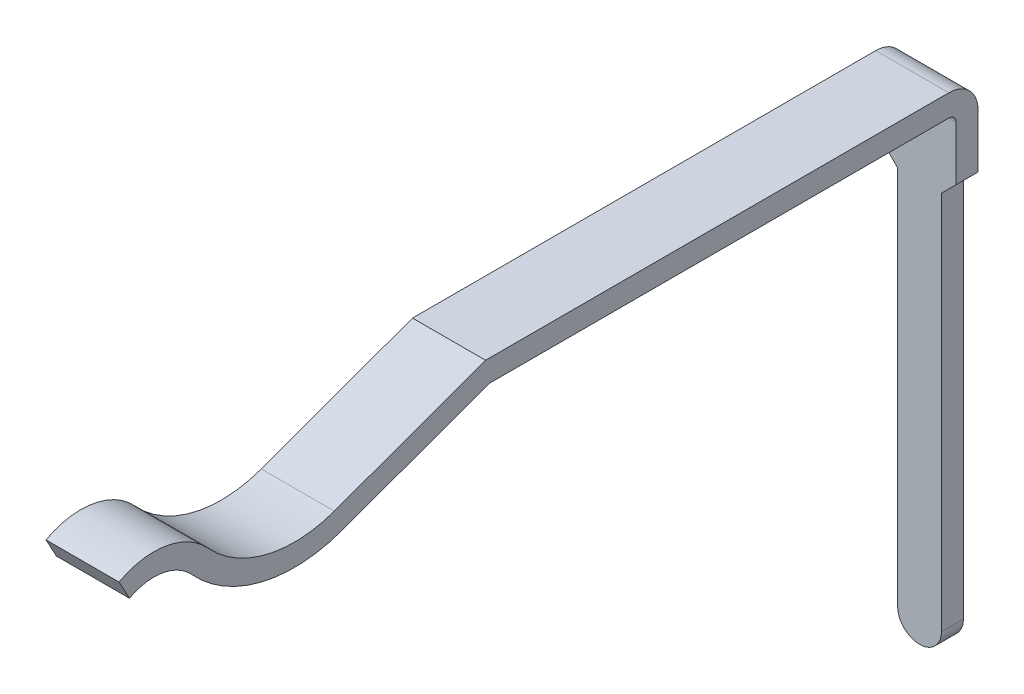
ISO-10303-21;
HEADER;
FILE_DESCRIPTION(('STEP AP214'),'2;1');
FILE_NAME('part.step','',(''),(''),'','','');
FILE_SCHEMA(('AUTOMOTIVE_DESIGN { 1 0 10303 214 1 1 1 1 }'));
ENDSEC;
DATA;
#1=APPLICATION_CONTEXT('core data for automotive mechanical design processes');
#2=APPLICATION_PROTOCOL_DEFINITION('international standard','automotive_design',2000,#1);
#3=PRODUCT_CONTEXT('',#1,'mechanical');
#4=PRODUCT('Part','Part','',(#3));
#5=PRODUCT_RELATED_PRODUCT_CATEGORY('part','',(#4));
#6=PRODUCT_DEFINITION_FORMATION('','',#4);
#7=PRODUCT_DEFINITION_CONTEXT('part definition',#1,'design');
#8=PRODUCT_DEFINITION('design','',#6,#7);
#9=PRODUCT_DEFINITION_SHAPE('','',#8);
#10=(LENGTH_UNIT() NAMED_UNIT(*) SI_UNIT(.MILLI.,.METRE.));
#11=(NAMED_UNIT(*) PLANE_ANGLE_UNIT() SI_UNIT($,.RADIAN.));
#12=(NAMED_UNIT(*) SI_UNIT($,.STERADIAN.) SOLID_ANGLE_UNIT());
#13=UNCERTAINTY_MEASURE_WITH_UNIT(LENGTH_MEASURE(1.E-05),#10,'distance_accuracy_value','');
#14=(GEOMETRIC_REPRESENTATION_CONTEXT(3) GLOBAL_UNCERTAINTY_ASSIGNED_CONTEXT((#13)) GLOBAL_UNIT_ASSIGNED_CONTEXT((#10,
#11,#12)) REPRESENTATION_CONTEXT('',''));
#15=CARTESIAN_POINT('',(0.,0.,0.));
#16=DIRECTION('',(0.,0.,1.));
#17=DIRECTION('',(1.,0.,0.));
#18=AXIS2_PLACEMENT_3D('',#15,#16,#17);
#19=CARTESIAN_POINT('',(-0.5,-1.14,-12.76));
#20=DIRECTION('',(-1.,0.,0.));
#21=DIRECTION('',(0.,0.,1.));
#22=AXIS2_PLACEMENT_3D('',#19,#20,#21);
#23=PLANE('',#22);
#24=DIRECTION('',(0.,-0.342020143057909,0.939692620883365));
#25=VECTOR('',#24,1.);
#26=CARTESIAN_POINT('',(-0.5,-0.6677079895,-5.060107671));
#27=LINE('',#26,#25);
#28=CARTESIAN_POINT('',(-0.5,-0.3,-6.07037707));
#29=VERTEX_POINT('',#28);
#30=CARTESIAN_POINT('',(-0.5,-1.03541597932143,-4.04983827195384));
#31=VERTEX_POINT('',#30);
#32=EDGE_CURVE('E218',#29,#31,#27,.T.);
#33=ORIENTED_EDGE('',*,*,#32,.T.);
#34=CARTESIAN_POINT('',(-0.5,0.75,-3.4));
#35=DIRECTION('',(-1.,0.,0.));
#36=DIRECTION('',(0.,0.,1.));
#37=AXIS2_PLACEMENT_3D('',#34,#35,#36);
#38=CIRCLE('',#37,1.9);
#39=CARTESIAN_POINT('',(-0.5,-0.528846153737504,-1.99481228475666));
#40=VERTEX_POINT('',#39);
#41=EDGE_CURVE('E312',#31,#40,#38,.T.);
#42=ORIENTED_EDGE('',*,*,#41,.T.);
#43=CARTESIAN_POINT('',(-0.5,-1.,-1.477111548));
#44=DIRECTION('',(-1.,0.,0.));
#45=DIRECTION('',(0.,0.,1.));
#46=AXIS2_PLACEMENT_3D('',#43,#44,#45);
#47=CIRCLE('',#46,0.7);
#48=CARTESIAN_POINT('',(-0.5,-0.384810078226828,-1.14313346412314));
#49=VERTEX_POINT('',#48);
#50=EDGE_CURVE('E274',#49,#40,#47,.T.);
#51=ORIENTED_EDGE('',*,*,#50,.F.);
#52=DIRECTION('',(0.,-0.878842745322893,-0.477111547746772));
#53=VECTOR('',#52,1.);
#54=CARTESIAN_POINT('',(-0.5,-0.2529836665,-1.071566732));
#55=LINE('',#54,#53);
#56=CARTESIAN_POINT('',(-0.5,-0.121157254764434,-1.00000000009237));
#57=VERTEX_POINT('',#56);
#58=EDGE_CURVE('E252',#57,#49,#55,.T.);
#59=ORIENTED_EDGE('',*,*,#58,.F.);
#60=CARTESIAN_POINT('',(-0.5,-1.,-1.477111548));
#61=DIRECTION('',(-1.,0.,0.));
#62=DIRECTION('',(0.,0.,1.));
#63=AXIS2_PLACEMENT_3D('',#60,#61,#62);
#64=CIRCLE('',#63,1.);
#65=CARTESIAN_POINT('',(-0.5,-0.326923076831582,-2.21668402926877));
#66=VERTEX_POINT('',#65);
#67=EDGE_CURVE('E249',#57,#66,#64,.T.);
#68=ORIENTED_EDGE('',*,*,#67,.T.);
#69=CARTESIAN_POINT('',(-0.5,0.75,-3.4));
#70=DIRECTION('',(-1.,0.,0.));
#71=DIRECTION('',(0.,0.,1.));
#72=AXIS2_PLACEMENT_3D('',#69,#70,#71);
#73=CIRCLE('',#72,1.6);
#74=CARTESIAN_POINT('',(-0.5,-0.753508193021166,-3.94723222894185));
#75=VERTEX_POINT('',#74);
#76=EDGE_CURVE('E245',#75,#66,#73,.T.);
#77=ORIENTED_EDGE('',*,*,#76,.F.);
#78=DIRECTION('',(0.,-0.342020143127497,0.939692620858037));
#79=VECTOR('',#78,1.);
#80=CARTESIAN_POINT('',(-0.5,-0.3767540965,-4.9823556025));
#81=LINE('',#80,#79);
#82=CARTESIAN_POINT('',(-0.5,0.,-6.017478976));
#83=VERTEX_POINT('',#82);
#84=EDGE_CURVE('E242',#83,#75,#81,.T.);
#85=ORIENTED_EDGE('',*,*,#84,.F.);
#86=DIRECTION('',(0.,0.,1.));
#87=VECTOR('',#86,1.);
#88=CARTESIAN_POINT('',(-0.5,0.,-9.188739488));
#89=LINE('',#88,#87);
#90=CARTESIAN_POINT('',(-0.5,0.,-12.360000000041));
#91=VERTEX_POINT('',#90);
#92=EDGE_CURVE('E237',#91,#83,#89,.T.);
#93=ORIENTED_EDGE('',*,*,#92,.F.);
#94=CARTESIAN_POINT('',(-0.5,-0.4,-12.36));
#95=DIRECTION('',(-1.,0.,0.));
#96=DIRECTION('',(0.,0.,1.));
#97=AXIS2_PLACEMENT_3D('',#94,#95,#96);
#98=CIRCLE('',#97,0.399999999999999);
#99=CARTESIAN_POINT('',(-0.5,-0.4,-12.76));
#100=VERTEX_POINT('',#99);
#101=EDGE_CURVE('E20',#91,#100,#98,.T.);
#102=ORIENTED_EDGE('',*,*,#101,.T.);
#103=DIRECTION('',(0.,-1.,0.));
#104=VECTOR('',#103,1.);
#105=CARTESIAN_POINT('',(-0.5,-0.5643,-12.76));
#106=LINE('',#105,#104);
#107=CARTESIAN_POINT('',(-0.50000000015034,-1.13999999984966,-12.76));
#108=VERTEX_POINT('',#107);
#109=EDGE_CURVE('E128',#100,#108,#106,.T.);
#110=ORIENTED_EDGE('',*,*,#109,.T.);
#111=DIRECTION('',(0.,0.,1.));
#112=VECTOR('',#111,1.);
#113=CARTESIAN_POINT('',(-0.5,-1.14,-6.84472));
#114=LINE('',#113,#112);
#115=CARTESIAN_POINT('',(-0.5,-1.14,-12.4599999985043));
#116=VERTEX_POINT('',#115);
#117=EDGE_CURVE('E263',#108,#116,#114,.T.);
#118=ORIENTED_EDGE('',*,*,#117,.T.);
#119=DIRECTION('',(0.,1.,0.));
#120=VECTOR('',#119,1.);
#121=CARTESIAN_POINT('',(-0.5,-0.5643,-12.4599999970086));
#122=LINE('',#121,#120);
#123=CARTESIAN_POINT('',(-0.5,-0.4,-12.4599999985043));
#124=VERTEX_POINT('',#123);
#125=EDGE_CURVE('E260',#116,#124,#122,.T.);
#126=ORIENTED_EDGE('',*,*,#125,.T.);
#127=CARTESIAN_POINT('',(-0.5,-0.4,-12.36));
#128=DIRECTION('',(-1.,0.,0.));
#129=DIRECTION('',(0.,0.,1.));
#130=AXIS2_PLACEMENT_3D('',#127,#128,#129);
#131=CIRCLE('',#130,0.100000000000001);
#132=CARTESIAN_POINT('',(-0.5,-0.3,-12.36));
#133=VERTEX_POINT('',#132);
#134=EDGE_CURVE('E262',#124,#133,#131,.F.);
#135=ORIENTED_EDGE('',*,*,#134,.T.);
#136=DIRECTION('',(0.,0.,1.));
#137=VECTOR('',#136,1.);
#138=CARTESIAN_POINT('',(-0.5,-0.3,-9.215188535));
#139=LINE('',#138,#137);
#140=EDGE_CURVE('E222',#133,#29,#139,.T.);
#141=ORIENTED_EDGE('',*,*,#140,.T.);
#142=EDGE_LOOP('',(#33,#42,#51,#59,#68,#77,#85,#93,#102,#110,#118,#126,#135,#141));
#143=FACE_BOUND('',#142,.T.);
#144=ADVANCED_FACE('F16',(#143),#23,.T.);
#145=CARTESIAN_POINT('',(0.5,-1.,-1.477111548));
#146=DIRECTION('',(-1.,0.,0.));
#147=DIRECTION('',(0.,0.,1.));
#148=AXIS2_PLACEMENT_3D('',#145,#146,#147);
#149=CYLINDRICAL_SURFACE('',#148,0.7);
#150=CARTESIAN_POINT('',(0.5,-1.,-1.477111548));
#151=DIRECTION('',(-1.,0.,0.));
#152=DIRECTION('',(0.,0.,1.));
#153=AXIS2_PLACEMENT_3D('',#150,#151,#152);
#154=CIRCLE('',#153,0.7);
#155=CARTESIAN_POINT('',(0.5,-0.528846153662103,-1.99481228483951));
#156=VERTEX_POINT('',#155);
#157=CARTESIAN_POINT('',(0.5,-0.384810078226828,-1.14313346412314));
#158=VERTEX_POINT('',#157);
#159=EDGE_CURVE('E235',#156,#158,#154,.F.);
#160=ORIENTED_EDGE('',*,*,#159,.T.);
#161=DIRECTION('',(1.,0.,0.));
#162=VECTOR('',#161,1.);
#163=CARTESIAN_POINT('',(0.,-0.384810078,-1.143133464));
#164=LINE('',#163,#162);
#165=EDGE_CURVE('E250',#49,#158,#164,.T.);
#166=ORIENTED_EDGE('',*,*,#165,.F.);
#167=ORIENTED_EDGE('',*,*,#50,.T.);
#168=DIRECTION('',(-1.,0.,0.));
#169=VECTOR('',#168,1.);
#170=CARTESIAN_POINT('',(0.,-0.528846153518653,-1.99481228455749));
#171=LINE('',#170,#169);
#172=EDGE_CURVE('E211',#40,#156,#171,.F.);
#173=ORIENTED_EDGE('',*,*,#172,.T.);
#174=EDGE_LOOP('',(#160,#166,#167,#173));
#175=FACE_BOUND('',#174,.T.);
#176=ADVANCED_FACE('F336',(#175),#149,.F.);
#177=CARTESIAN_POINT('',(-0.5,-0.121157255,-1.));
#178=DIRECTION('',(0.,-0.477111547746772,0.878842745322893));
#179=DIRECTION('',(0.,-0.878842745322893,-0.477111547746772));
#180=AXIS2_PLACEMENT_3D('',#177,#178,#179);
#181=PLANE('',#180);
#182=DIRECTION('',(0.,-0.878842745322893,-0.477111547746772));
#183=VECTOR('',#182,1.);
#184=CARTESIAN_POINT('',(0.5,-0.121157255,-1.));
#185=LINE('',#184,#183);
#186=CARTESIAN_POINT('',(0.5,-0.121157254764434,-1.00000000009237));
#187=VERTEX_POINT('',#186);
#188=EDGE_CURVE('E302',#158,#187,#185,.F.);
#189=ORIENTED_EDGE('',*,*,#188,.T.);
#190=DIRECTION('',(1.,0.,0.));
#191=VECTOR('',#190,1.);
#192=CARTESIAN_POINT('',(0.,-0.121157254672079,-1.00000000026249));
#193=LINE('',#192,#191);
#194=EDGE_CURVE('E246',#187,#57,#193,.F.);
#195=ORIENTED_EDGE('',*,*,#194,.T.);
#196=ORIENTED_EDGE('',*,*,#58,.T.);
#197=ORIENTED_EDGE('',*,*,#165,.T.);
#198=EDGE_LOOP('',(#189,#195,#196,#197));
#199=FACE_BOUND('',#198,.T.);
#200=ADVANCED_FACE('F376',(#199),#181,.T.);
#201=CARTESIAN_POINT('',(0.5,-1.,-1.477111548));
#202=DIRECTION('',(-1.,0.,0.));
#203=DIRECTION('',(0.,0.,1.));
#204=AXIS2_PLACEMENT_3D('',#201,#202,#203);
#205=CYLINDRICAL_SURFACE('',#204,1.);
#206=ORIENTED_EDGE('',*,*,#194,.F.);
#207=CARTESIAN_POINT('',(0.5,-1.,-1.477111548));
#208=DIRECTION('',(-1.,0.,0.));
#209=DIRECTION('',(0.,0.,1.));
#210=AXIS2_PLACEMENT_3D('',#207,#208,#209);
#211=CIRCLE('',#210,1.);
#212=CARTESIAN_POINT('',(0.5,-0.326923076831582,-2.21668402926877));
#213=VERTEX_POINT('',#212);
#214=EDGE_CURVE('E299',#187,#213,#211,.T.);
#215=ORIENTED_EDGE('',*,*,#214,.T.);
#216=DIRECTION('',(-1.,0.,0.));
#217=VECTOR('',#216,1.);
#218=CARTESIAN_POINT('',(0.,-0.326923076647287,-2.21668402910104));
#219=LINE('',#218,#217);
#220=EDGE_CURVE('E243',#66,#213,#219,.F.);
#221=ORIENTED_EDGE('',*,*,#220,.F.);
#222=ORIENTED_EDGE('',*,*,#67,.F.);
#223=EDGE_LOOP('',(#206,#215,#221,#222));
#224=FACE_BOUND('',#223,.T.);
#225=ADVANCED_FACE('F373',(#224),#205,.T.);
#226=CARTESIAN_POINT('',(0.5,0.75,-3.4));
#227=DIRECTION('',(-1.,0.,0.));
#228=DIRECTION('',(0.,0.,1.));
#229=AXIS2_PLACEMENT_3D('',#226,#227,#228);
#230=CYLINDRICAL_SURFACE('',#229,1.6);
#231=CARTESIAN_POINT('',(0.5,0.75,-3.4));
#232=DIRECTION('',(-1.,0.,0.));
#233=DIRECTION('',(0.,0.,1.));
#234=AXIS2_PLACEMENT_3D('',#231,#232,#233);
#235=CIRCLE('',#234,1.6);
#236=CARTESIAN_POINT('',(0.5,-0.753508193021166,-3.94723222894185));
#237=VERTEX_POINT('',#236);
#238=EDGE_CURVE('E296',#213,#237,#235,.F.);
#239=ORIENTED_EDGE('',*,*,#238,.T.);
#240=DIRECTION('',(1.,0.,0.));
#241=VECTOR('',#240,1.);
#242=CARTESIAN_POINT('',(0.,-0.753508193,-3.947232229));
#243=LINE('',#242,#241);
#244=EDGE_CURVE('E240',#75,#237,#243,.T.);
#245=ORIENTED_EDGE('',*,*,#244,.F.);
#246=ORIENTED_EDGE('',*,*,#76,.T.);
#247=ORIENTED_EDGE('',*,*,#220,.T.);
#248=EDGE_LOOP('',(#239,#245,#246,#247));
#249=FACE_BOUND('',#248,.T.);
#250=ADVANCED_FACE('F369',(#249),#230,.F.);
#251=CARTESIAN_POINT('',(-0.5,0.,-6.017478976));
#252=DIRECTION('',(0.,0.939692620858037,0.342020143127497));
#253=DIRECTION('',(0.,-0.342020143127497,0.939692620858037));
#254=AXIS2_PLACEMENT_3D('',#251,#252,#253);
#255=PLANE('',#254);
#256=DIRECTION('',(0.,-0.342020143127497,0.939692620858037));
#257=VECTOR('',#256,1.);
#258=CARTESIAN_POINT('',(0.5,0.,-6.017478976));
#259=LINE('',#258,#257);
#260=CARTESIAN_POINT('',(0.5,0.,-6.017478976));
#261=VERTEX_POINT('',#260);
#262=EDGE_CURVE('E205',#237,#261,#259,.F.);
#263=ORIENTED_EDGE('',*,*,#262,.T.);
#264=DIRECTION('',(1.,0.,0.));
#265=VECTOR('',#264,1.);
#266=CARTESIAN_POINT('',(0.,0.,-6.017478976));
#267=LINE('',#266,#265);
#268=EDGE_CURVE('E228',#83,#261,#267,.T.);
#269=ORIENTED_EDGE('',*,*,#268,.F.);
#270=ORIENTED_EDGE('',*,*,#84,.T.);
#271=ORIENTED_EDGE('',*,*,#244,.T.);
#272=EDGE_LOOP('',(#263,#269,#270,#271));
#273=FACE_BOUND('',#272,.T.);
#274=ADVANCED_FACE('F363',(#273),#255,.T.);
#275=CARTESIAN_POINT('',(-0.5,0.,-12.36));
#276=DIRECTION('',(0.,1.,0.));
#277=DIRECTION('',(0.,0.,1.));
#278=AXIS2_PLACEMENT_3D('',#275,#276,#277);
#279=PLANE('',#278);
#280=DIRECTION('',(0.,0.,-1.));
#281=VECTOR('',#280,1.);
#282=CARTESIAN_POINT('',(0.5,0.,-6.84472));
#283=LINE('',#282,#281);
#284=CARTESIAN_POINT('',(0.5,0.,-12.360000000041));
#285=VERTEX_POINT('',#284);
#286=EDGE_CURVE('E201',#261,#285,#283,.T.);
#287=ORIENTED_EDGE('',*,*,#286,.T.);
#288=DIRECTION('',(1.,0.,0.));
#289=VECTOR('',#288,1.);
#290=CARTESIAN_POINT('',(0.,0.,-12.360000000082));
#291=LINE('',#290,#289);
#292=EDGE_CURVE('E214',#285,#91,#291,.F.);
#293=ORIENTED_EDGE('',*,*,#292,.T.);
#294=ORIENTED_EDGE('',*,*,#92,.T.);
#295=ORIENTED_EDGE('',*,*,#268,.T.);
#296=EDGE_LOOP('',(#287,#293,#294,#295));
#297=FACE_BOUND('',#296,.T.);
#298=ADVANCED_FACE('F359',(#297),#279,.T.);
#299=CARTESIAN_POINT('',(-0.5,-0.3,-12.36));
#300=DIRECTION('',(0.,1.,0.));
#301=DIRECTION('',(0.,0.,1.));
#302=AXIS2_PLACEMENT_3D('',#299,#300,#301);
#303=PLANE('',#302);
#304=DIRECTION('',(-1.,0.,0.));
#305=VECTOR('',#304,1.);
#306=CARTESIAN_POINT('',(0.,-0.3,-12.36));
#307=LINE('',#306,#305);
#308=CARTESIAN_POINT('',(0.5,-0.30000000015,-12.36));
#309=VERTEX_POINT('',#308);
#310=EDGE_CURVE('E225',#309,#133,#307,.T.);
#311=ORIENTED_EDGE('',*,*,#310,.F.);
#312=DIRECTION('',(0.,0.,1.));
#313=VECTOR('',#312,1.);
#314=CARTESIAN_POINT('',(0.5,-0.3000000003,-6.84472));
#315=LINE('',#314,#313);
#316=CARTESIAN_POINT('',(0.5,-0.30000000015,-6.07037706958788));
#317=VERTEX_POINT('',#316);
#318=EDGE_CURVE('E192',#309,#317,#315,.T.);
#319=ORIENTED_EDGE('',*,*,#318,.T.);
#320=DIRECTION('',(-1.,0.,0.));
#321=VECTOR('',#320,1.);
#322=CARTESIAN_POINT('',(0.,-0.3,-6.07037707));
#323=LINE('',#322,#321);
#324=EDGE_CURVE('E219',#317,#29,#323,.T.);
#325=ORIENTED_EDGE('',*,*,#324,.T.);
#326=ORIENTED_EDGE('',*,*,#140,.F.);
#327=EDGE_LOOP('',(#311,#319,#325,#326));
#328=FACE_BOUND('',#327,.T.);
#329=ADVANCED_FACE('F321',(#328),#303,.F.);
#330=CARTESIAN_POINT('',(-0.5,-0.3,-6.07037707));
#331=DIRECTION('',(0.,0.939692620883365,0.342020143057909));
#332=DIRECTION('',(0.,-0.342020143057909,0.939692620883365));
#333=AXIS2_PLACEMENT_3D('',#330,#331,#332);
#334=PLANE('',#333);
#335=ORIENTED_EDGE('',*,*,#324,.F.);
#336=DIRECTION('',(0.,-0.342020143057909,0.939692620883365));
#337=VECTOR('',#336,1.);
#338=CARTESIAN_POINT('',(0.5,-0.3,-6.07037707));
#339=LINE('',#338,#337);
#340=CARTESIAN_POINT('',(0.5,-1.03541597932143,-4.04983827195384));
#341=VERTEX_POINT('',#340);
#342=EDGE_CURVE('E195',#317,#341,#339,.T.);
#343=ORIENTED_EDGE('',*,*,#342,.T.);
#344=DIRECTION('',(1.,0.,0.));
#345=VECTOR('',#344,1.);
#346=CARTESIAN_POINT('',(0.,-1.03541597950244,-4.04983827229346));
#347=LINE('',#346,#345);
#348=EDGE_CURVE('E215',#341,#31,#347,.F.);
#349=ORIENTED_EDGE('',*,*,#348,.T.);
#350=ORIENTED_EDGE('',*,*,#32,.F.);
#351=EDGE_LOOP('',(#335,#343,#349,#350));
#352=FACE_BOUND('',#351,.T.);
#353=ADVANCED_FACE('F330',(#352),#334,.F.);
#354=CARTESIAN_POINT('',(0.5,0.75,-3.4));
#355=DIRECTION('',(-1.,0.,0.));
#356=DIRECTION('',(0.,0.,1.));
#357=AXIS2_PLACEMENT_3D('',#354,#355,#356);
#358=CYLINDRICAL_SURFACE('',#357,1.9);
#359=ORIENTED_EDGE('',*,*,#348,.F.);
#360=CARTESIAN_POINT('',(0.5,0.75,-3.4));
#361=DIRECTION('',(-1.,0.,0.));
#362=DIRECTION('',(0.,0.,1.));
#363=AXIS2_PLACEMENT_3D('',#360,#361,#362);
#364=CIRCLE('',#363,1.9);
#365=EDGE_CURVE('E207',#341,#156,#364,.T.);
#366=ORIENTED_EDGE('',*,*,#365,.T.);
#367=ORIENTED_EDGE('',*,*,#172,.F.);
#368=ORIENTED_EDGE('',*,*,#41,.F.);
#369=EDGE_LOOP('',(#359,#366,#367,#368));
#370=FACE_BOUND('',#369,.T.);
#371=ADVANCED_FACE('F337',(#370),#358,.T.);
#372=CARTESIAN_POINT('',(0.5,-0.4,-12.36));
#373=DIRECTION('',(-1.,0.,0.));
#374=DIRECTION('',(0.,0.,1.));
#375=AXIS2_PLACEMENT_3D('',#372,#373,#374);
#376=CYLINDRICAL_SURFACE('',#375,0.399999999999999);
#377=ORIENTED_EDGE('',*,*,#292,.F.);
#378=CARTESIAN_POINT('',(0.5,-0.4,-12.36));
#379=DIRECTION('',(-1.,0.,0.));
#380=DIRECTION('',(0.,0.,1.));
#381=AXIS2_PLACEMENT_3D('',#378,#379,#380);
#382=CIRCLE('',#381,0.399999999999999);
#383=CARTESIAN_POINT('',(0.5,-0.4,-12.76));
#384=VERTEX_POINT('',#383);
#385=EDGE_CURVE('E204',#285,#384,#382,.T.);
#386=ORIENTED_EDGE('',*,*,#385,.T.);
#387=DIRECTION('',(1.,0.,0.));
#388=VECTOR('',#387,1.);
#389=CARTESIAN_POINT('',(0.,-0.4,-12.76));
#390=LINE('',#389,#388);
#391=EDGE_CURVE('E183',#100,#384,#390,.T.);
#392=ORIENTED_EDGE('',*,*,#391,.F.);
#393=ORIENTED_EDGE('',*,*,#101,.F.);
#394=EDGE_LOOP('',(#377,#386,#392,#393));
#395=FACE_BOUND('',#394,.T.);
#396=ADVANCED_FACE('F339',(#395),#376,.T.);
#397=CARTESIAN_POINT('',(0.5,-1.14,-12.76));
#398=DIRECTION('',(-1.,0.,0.));
#399=DIRECTION('',(0.,0.,1.));
#400=AXIS2_PLACEMENT_3D('',#397,#398,#399);
#401=PLANE('',#400);
#402=ORIENTED_EDGE('',*,*,#365,.F.);
#403=ORIENTED_EDGE('',*,*,#342,.F.);
#404=ORIENTED_EDGE('',*,*,#318,.F.);
#405=CARTESIAN_POINT('',(0.5,-0.4,-12.36));
#406=DIRECTION('',(-1.,0.,0.));
#407=DIRECTION('',(0.,0.,1.));
#408=AXIS2_PLACEMENT_3D('',#405,#406,#407);
#409=CIRCLE('',#408,0.100000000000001);
#410=CARTESIAN_POINT('',(0.5,-0.4,-12.4599999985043));
#411=VERTEX_POINT('',#410);
#412=EDGE_CURVE('E196',#411,#309,#409,.F.);
#413=ORIENTED_EDGE('',*,*,#412,.F.);
#414=DIRECTION('',(0.,1.,0.));
#415=VECTOR('',#414,1.);
#416=CARTESIAN_POINT('',(0.5,-0.5643,-12.4599999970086));
#417=LINE('',#416,#415);
#418=CARTESIAN_POINT('',(0.5,-1.14,-12.4599999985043));
#419=VERTEX_POINT('',#418);
#420=EDGE_CURVE('E197',#419,#411,#417,.T.);
#421=ORIENTED_EDGE('',*,*,#420,.F.);
#422=DIRECTION('',(0.,0.,1.));
#423=VECTOR('',#422,1.);
#424=CARTESIAN_POINT('',(0.5,-1.14,-6.84472));
#425=LINE('',#424,#423);
#426=CARTESIAN_POINT('',(0.5,-1.14,-12.76));
#427=VERTEX_POINT('',#426);
#428=EDGE_CURVE('E200',#427,#419,#425,.T.);
#429=ORIENTED_EDGE('',*,*,#428,.F.);
#430=DIRECTION('',(0.,-1.,0.));
#431=VECTOR('',#430,1.);
#432=CARTESIAN_POINT('',(0.5,-3.63932,-12.76));
#433=LINE('',#432,#431);
#434=EDGE_CURVE('E149',#384,#427,#433,.T.);
#435=ORIENTED_EDGE('',*,*,#434,.F.);
#436=ORIENTED_EDGE('',*,*,#385,.F.);
#437=ORIENTED_EDGE('',*,*,#286,.F.);
#438=ORIENTED_EDGE('',*,*,#262,.F.);
#439=ORIENTED_EDGE('',*,*,#238,.F.);
#440=ORIENTED_EDGE('',*,*,#214,.F.);
#441=ORIENTED_EDGE('',*,*,#188,.F.);
#442=ORIENTED_EDGE('',*,*,#159,.F.);
#443=EDGE_LOOP('',(#402,#403,#404,#413,#421,#429,#435,#436,#437,#438,#439,#440,#441,#442));
#444=FACE_BOUND('',#443,.T.);
#445=ADVANCED_FACE('F326',(#444),#401,.F.);
#446=CARTESIAN_POINT('',(-0.5,-6.87864,-12.76));
#447=DIRECTION('',(0.,0.,-1.));
#448=DIRECTION('',(0.,1.,0.));
#449=AXIS2_PLACEMENT_3D('',#446,#447,#448);
#450=PLANE('',#449);
#451=ORIENTED_EDGE('',*,*,#391,.T.);
#452=ORIENTED_EDGE('',*,*,#434,.T.);
#453=DIRECTION('',(-0.707106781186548,-0.707106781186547,0.));
#454=VECTOR('',#453,1.);
#455=CARTESIAN_POINT('',(0.4,-1.24,-12.76));
#456=LINE('',#455,#454);
#457=CARTESIAN_POINT('',(0.3,-1.34,-12.76));
#458=VERTEX_POINT('',#457);
#459=EDGE_CURVE('E145',#427,#458,#456,.T.);
#460=ORIENTED_EDGE('',*,*,#459,.T.);
#461=DIRECTION('',(0.,-1.,0.));
#462=VECTOR('',#461,1.);
#463=CARTESIAN_POINT('',(0.3,-3.94,-12.76));
#464=LINE('',#463,#462);
#465=CARTESIAN_POINT('',(0.3,-6.54,-12.76));
#466=VERTEX_POINT('',#465);
#467=EDGE_CURVE('E147',#458,#466,#464,.T.);
#468=ORIENTED_EDGE('',*,*,#467,.T.);
#469=CARTESIAN_POINT('',(0.,-6.54,-12.76));
#470=DIRECTION('',(0.,0.,1.));
#471=DIRECTION('',(0.,-1.,0.));
#472=AXIS2_PLACEMENT_3D('',#469,#470,#471);
#473=CIRCLE('',#472,0.3);
#474=CARTESIAN_POINT('',(-0.3,-6.54,-12.76));
#475=VERTEX_POINT('',#474);
#476=EDGE_CURVE('E172',#466,#475,#473,.F.);
#477=ORIENTED_EDGE('',*,*,#476,.T.);
#478=DIRECTION('',(0.,1.,0.));
#479=VECTOR('',#478,1.);
#480=CARTESIAN_POINT('',(-0.3,-3.94,-12.76));
#481=LINE('',#480,#479);
#482=CARTESIAN_POINT('',(-0.299999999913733,-1.3400000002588,-12.76));
#483=VERTEX_POINT('',#482);
#484=EDGE_CURVE('E171',#475,#483,#481,.T.);
#485=ORIENTED_EDGE('',*,*,#484,.T.);
#486=DIRECTION('',(-0.707106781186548,0.707106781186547,0.));
#487=VECTOR('',#486,1.);
#488=CARTESIAN_POINT('',(-0.4,-1.24,-12.76));
#489=LINE('',#488,#487);
#490=EDGE_CURVE('E152',#483,#108,#489,.T.);
#491=ORIENTED_EDGE('',*,*,#490,.T.);
#492=ORIENTED_EDGE('',*,*,#109,.F.);
#493=EDGE_LOOP('',(#451,#452,#460,#468,#477,#485,#491,#492));
#494=FACE_BOUND('',#493,.T.);
#495=ADVANCED_FACE('F146',(#494),#450,.T.);
#496=CARTESIAN_POINT('',(0.,-6.54,-12.76));
#497=DIRECTION('',(0.,0.,1.));
#498=DIRECTION('',(0.,-1.,0.));
#499=AXIS2_PLACEMENT_3D('',#496,#497,#498);
#500=CYLINDRICAL_SURFACE('',#499,0.3);
#501=ORIENTED_EDGE('',*,*,#476,.F.);
#502=DIRECTION('',(0.,0.,1.));
#503=VECTOR('',#502,1.);
#504=CARTESIAN_POINT('',(0.3,-6.54,-12.61));
#505=LINE('',#504,#503);
#506=CARTESIAN_POINT('',(0.3,-6.54,-12.46));
#507=VERTEX_POINT('',#506);
#508=EDGE_CURVE('E157',#466,#507,#505,.T.);
#509=ORIENTED_EDGE('',*,*,#508,.T.);
#510=CARTESIAN_POINT('',(0.,-6.54,-12.46));
#511=DIRECTION('',(0.,0.,1.));
#512=DIRECTION('',(0.,-1.,0.));
#513=AXIS2_PLACEMENT_3D('',#510,#511,#512);
#514=CIRCLE('',#513,0.3);
#515=CARTESIAN_POINT('',(-0.3,-6.54,-12.46));
#516=VERTEX_POINT('',#515);
#517=EDGE_CURVE('E282',#507,#516,#514,.F.);
#518=ORIENTED_EDGE('',*,*,#517,.T.);
#519=DIRECTION('',(0.,0.,-1.));
#520=VECTOR('',#519,1.);
#521=CARTESIAN_POINT('',(-0.3,-6.54,-12.61));
#522=LINE('',#521,#520);
#523=EDGE_CURVE('E168',#516,#475,#522,.T.);
#524=ORIENTED_EDGE('',*,*,#523,.T.);
#525=EDGE_LOOP('',(#501,#509,#518,#524));
#526=FACE_BOUND('',#525,.T.);
#527=ADVANCED_FACE('F397',(#526),#500,.T.);
#528=CARTESIAN_POINT('',(-0.3,-6.54,-12.76));
#529=DIRECTION('',(1.,0.,0.));
#530=DIRECTION('',(0.,1.,0.));
#531=AXIS2_PLACEMENT_3D('',#528,#529,#530);
#532=PLANE('',#531);
#533=ORIENTED_EDGE('',*,*,#484,.F.);
#534=ORIENTED_EDGE('',*,*,#523,.F.);
#535=DIRECTION('',(0.,1.,0.));
#536=VECTOR('',#535,1.);
#537=CARTESIAN_POINT('',(-0.3,-3.63932,-12.46));
#538=LINE('',#537,#536);
#539=CARTESIAN_POINT('',(-0.3,-1.34,-12.46));
#540=VERTEX_POINT('',#539);
#541=EDGE_CURVE('E281',#516,#540,#538,.T.);
#542=ORIENTED_EDGE('',*,*,#541,.T.);
#543=DIRECTION('',(0.,0.,-1.));
#544=VECTOR('',#543,1.);
#545=CARTESIAN_POINT('',(-0.3,-1.34,-12.61));
#546=LINE('',#545,#544);
#547=EDGE_CURVE('E173',#540,#483,#546,.T.);
#548=ORIENTED_EDGE('',*,*,#547,.T.);
#549=EDGE_LOOP('',(#533,#534,#542,#548));
#550=FACE_BOUND('',#549,.T.);
#551=ADVANCED_FACE('F398',(#550),#532,.F.);
#552=CARTESIAN_POINT('',(-0.3,-1.34,-12.76));
#553=DIRECTION('',(0.707106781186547,0.707106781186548,0.));
#554=DIRECTION('',(-0.707106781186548,0.707106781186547,0.));
#555=AXIS2_PLACEMENT_3D('',#552,#553,#554);
#556=PLANE('',#555);
#557=ORIENTED_EDGE('',*,*,#490,.F.);
#558=ORIENTED_EDGE('',*,*,#547,.F.);
#559=DIRECTION('',(-0.707106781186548,0.707106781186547,0.));
#560=VECTOR('',#559,1.);
#561=CARTESIAN_POINT('',(-0.3,-1.34,-12.46));
#562=LINE('',#561,#560);
#563=EDGE_CURVE('E232',#540,#116,#562,.T.);
#564=ORIENTED_EDGE('',*,*,#563,.T.);
#565=ORIENTED_EDGE('',*,*,#117,.F.);
#566=EDGE_LOOP('',(#557,#558,#564,#565));
#567=FACE_BOUND('',#566,.T.);
#568=ADVANCED_FACE('F401',(#567),#556,.F.);
#569=CARTESIAN_POINT('',(0.5,-0.4,-12.36));
#570=DIRECTION('',(-1.,0.,0.));
#571=DIRECTION('',(0.,0.,1.));
#572=AXIS2_PLACEMENT_3D('',#569,#570,#571);
#573=CYLINDRICAL_SURFACE('',#572,0.100000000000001);
#574=ORIENTED_EDGE('',*,*,#412,.T.);
#575=ORIENTED_EDGE('',*,*,#310,.T.);
#576=ORIENTED_EDGE('',*,*,#134,.F.);
#577=DIRECTION('',(1.,0.,0.));
#578=VECTOR('',#577,1.);
#579=CARTESIAN_POINT('',(0.,-0.4,-12.46));
#580=LINE('',#579,#578);
#581=EDGE_CURVE('E229',#124,#411,#580,.T.);
#582=ORIENTED_EDGE('',*,*,#581,.T.);
#583=EDGE_LOOP('',(#574,#575,#576,#582));
#584=FACE_BOUND('',#583,.T.);
#585=ADVANCED_FACE('F323',(#584),#573,.F.);
#586=CARTESIAN_POINT('',(0.5,-1.14,-12.76));
#587=DIRECTION('',(-0.707106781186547,0.707106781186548,0.));
#588=DIRECTION('',(-0.707106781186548,-0.707106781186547,0.));
#589=AXIS2_PLACEMENT_3D('',#586,#587,#588);
#590=PLANE('',#589);
#591=ORIENTED_EDGE('',*,*,#459,.F.);
#592=ORIENTED_EDGE('',*,*,#428,.T.);
#593=DIRECTION('',(-0.707106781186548,-0.707106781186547,0.));
#594=VECTOR('',#593,1.);
#595=CARTESIAN_POINT('',(0.5,-1.14,-12.46));
#596=LINE('',#595,#594);
#597=CARTESIAN_POINT('',(0.3,-1.34,-12.46));
#598=VERTEX_POINT('',#597);
#599=EDGE_CURVE('E26',#419,#598,#596,.T.);
#600=ORIENTED_EDGE('',*,*,#599,.T.);
#601=DIRECTION('',(0.,0.,-1.));
#602=VECTOR('',#601,1.);
#603=CARTESIAN_POINT('',(0.3,-1.34,-12.61));
#604=LINE('',#603,#602);
#605=EDGE_CURVE('E34',#598,#458,#604,.T.);
#606=ORIENTED_EDGE('',*,*,#605,.T.);
#607=EDGE_LOOP('',(#591,#592,#600,#606));
#608=FACE_BOUND('',#607,.T.);
#609=ADVANCED_FACE('F160',(#608),#590,.F.);
#610=CARTESIAN_POINT('',(0.3,-1.34,-12.76));
#611=DIRECTION('',(-1.,0.,0.));
#612=DIRECTION('',(0.,-1.,0.));
#613=AXIS2_PLACEMENT_3D('',#610,#611,#612);
#614=PLANE('',#613);
#615=ORIENTED_EDGE('',*,*,#467,.F.);
#616=ORIENTED_EDGE('',*,*,#605,.F.);
#617=DIRECTION('',(0.,-1.,0.));
#618=VECTOR('',#617,1.);
#619=CARTESIAN_POINT('',(0.3,-3.63932,-12.46));
#620=LINE('',#619,#618);
#621=EDGE_CURVE('E11',#598,#507,#620,.T.);
#622=ORIENTED_EDGE('',*,*,#621,.T.);
#623=ORIENTED_EDGE('',*,*,#508,.F.);
#624=EDGE_LOOP('',(#615,#616,#622,#623));
#625=FACE_BOUND('',#624,.T.);
#626=ADVANCED_FACE('F155',(#625),#614,.F.);
#627=CARTESIAN_POINT('',(-0.5,-6.87864,-12.46));
#628=DIRECTION('',(0.,0.,-1.));
#629=DIRECTION('',(0.,1.,0.));
#630=AXIS2_PLACEMENT_3D('',#627,#628,#629);
#631=PLANE('',#630);
#632=ORIENTED_EDGE('',*,*,#599,.F.);
#633=ORIENTED_EDGE('',*,*,#420,.T.);
#634=ORIENTED_EDGE('',*,*,#581,.F.);
#635=ORIENTED_EDGE('',*,*,#125,.F.);
#636=ORIENTED_EDGE('',*,*,#563,.F.);
#637=ORIENTED_EDGE('',*,*,#541,.F.);
#638=ORIENTED_EDGE('',*,*,#517,.F.);
#639=ORIENTED_EDGE('',*,*,#621,.F.);
#640=EDGE_LOOP('',(#632,#633,#634,#635,#636,#637,#638,#639));
#641=FACE_BOUND('',#640,.T.);
#642=ADVANCED_FACE('F18',(#641),#631,.F.);
#643=CLOSED_SHELL('',(#144,#176,#200,#225,#250,#274,#298,#329,#353,#371,#396,#445,#495,#527,
#551,#568,#585,#609,#626,#642));
#644=MANIFOLD_SOLID_BREP('B1',#643);
#645=ADVANCED_BREP_SHAPE_REPRESENTATION('',(#18,#644),#14);
#646=SHAPE_DEFINITION_REPRESENTATION(#9,#645);
ENDSEC;
END-ISO-10303-21;
